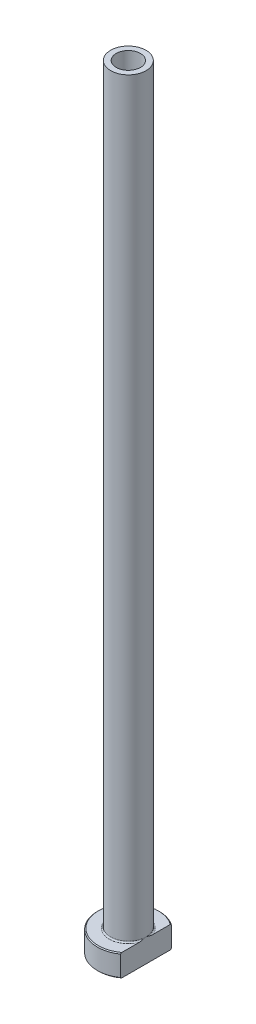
from build123d import *

# Parameters (mm, degrees)
FILLET1_R          = 0.3
CHAMFER1_SIZE      = 0.2
CUT_EXTRUDE1_DEPTH = 176.279776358
CHAMFER2_SIZE      = 0.5


with BuildPart() as part:
    # Sketch1 → Revolve1 (revolve)
    with BuildSketch(Plane.XY, mode=Mode.PRIVATE) as revolve1_sk:
        Polygon((-2.75, 175), (-4, 175), (-4, 5), (-7, 5), (-7, 0), (-3, 0), (-3, 118), (-2.75, 130), align=None)
    revolve(revolve1_sk.sketch.rotate(Axis((0, 92.187680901, 0), (0, -1, 0)), 270), axis=Axis((0, 92.187680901, 0), (0, -1, 0)))

    # Fillet1
    fillet1_edges = [part.edges().sort_by_distance(p)[0] for p in [
        (0, 5, -4),
    ]]
    fillet(fillet1_edges, radius=FILLET1_R)

    # Chamfer1
    chamfer1_edges = [part.edges().sort_by_distance(p)[0] for p in [
        (0, 0, -7),
        (0, 5, -7),
    ]]
    chamfer(chamfer1_edges, length=CHAMFER1_SIZE)

    # Sketch2 → Cut-Extrude1 (cut, through all)
    with BuildSketch(Plane.XZ):
        with BuildLine():
            Line((4, 5.744562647), (4, -5.744562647))
            ThreePointArc((4, -5.744562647), (7, 0), (4, 5.744562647))
        make_face()
    extrude(amount=-CUT_EXTRUDE1_DEPTH, mode=Mode.SUBTRACT)

    # Chamfer2
    chamfer2_edges = [part.edges().sort_by_distance(p)[0] for p in [
        (0, 0, -3),
    ]]
    chamfer(chamfer2_edges, length=CHAMFER2_SIZE)


solid = part.part
